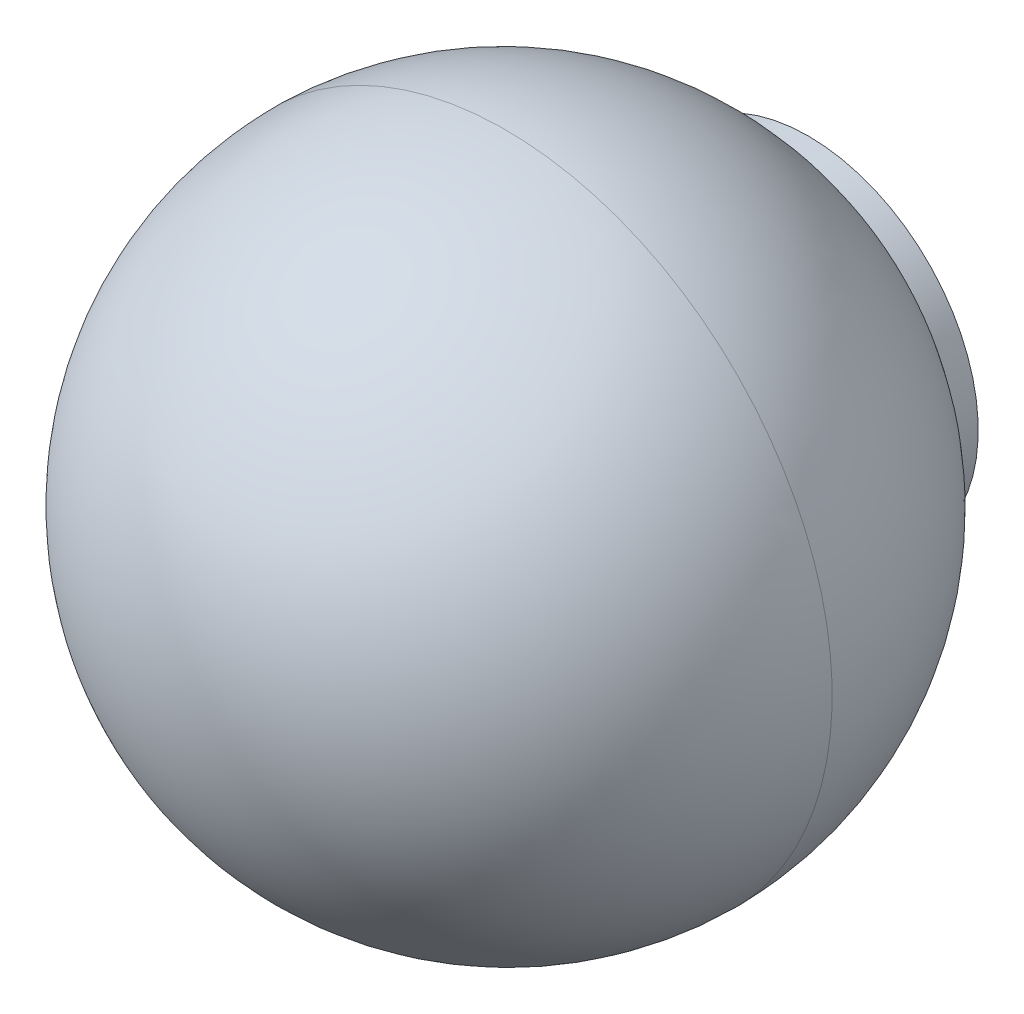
ISO-10303-21;
HEADER;
FILE_DESCRIPTION(('STEP AP214'),'2;1');
FILE_NAME('part.step','',(''),(''),'','','');
FILE_SCHEMA(('AUTOMOTIVE_DESIGN { 1 0 10303 214 1 1 1 1 }'));
ENDSEC;
DATA;
#1=APPLICATION_CONTEXT('core data for automotive mechanical design processes');
#2=APPLICATION_PROTOCOL_DEFINITION('international standard','automotive_design',2000,#1);
#3=PRODUCT_CONTEXT('',#1,'mechanical');
#4=PRODUCT('Part','Part','',(#3));
#5=PRODUCT_RELATED_PRODUCT_CATEGORY('part','',(#4));
#6=PRODUCT_DEFINITION_FORMATION('','',#4);
#7=PRODUCT_DEFINITION_CONTEXT('part definition',#1,'design');
#8=PRODUCT_DEFINITION('design','',#6,#7);
#9=PRODUCT_DEFINITION_SHAPE('','',#8);
#10=(LENGTH_UNIT() NAMED_UNIT(*) SI_UNIT(.MILLI.,.METRE.));
#11=(NAMED_UNIT(*) PLANE_ANGLE_UNIT() SI_UNIT($,.RADIAN.));
#12=(NAMED_UNIT(*) SI_UNIT($,.STERADIAN.) SOLID_ANGLE_UNIT());
#13=UNCERTAINTY_MEASURE_WITH_UNIT(LENGTH_MEASURE(1.E-05),#10,'distance_accuracy_value','');
#14=(GEOMETRIC_REPRESENTATION_CONTEXT(3) GLOBAL_UNCERTAINTY_ASSIGNED_CONTEXT((#13)) GLOBAL_UNIT_ASSIGNED_CONTEXT((#10,
#11,#12)) REPRESENTATION_CONTEXT('',''));
#15=CARTESIAN_POINT('',(0.,0.,0.));
#16=DIRECTION('',(0.,0.,1.));
#17=DIRECTION('',(1.,0.,0.));
#18=AXIS2_PLACEMENT_3D('',#15,#16,#17);
#19=CARTESIAN_POINT('',(0.,0.,23.0000000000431));
#20=DIRECTION('',(0.,0.,1.));
#21=DIRECTION('',(-1.,0.,0.));
#22=AXIS2_PLACEMENT_3D('',#19,#20,#21);
#23=SPHERICAL_SURFACE('',#22,24.9999999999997);
#24=CARTESIAN_POINT('',(0.,0.,23.1770782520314));
#25=DIRECTION('',(0.,0.,1.));
#26=DIRECTION('',(0.,-1.,0.));
#27=AXIS2_PLACEMENT_3D('',#24,#25,#26);
#28=CIRCLE('',#27,24.999372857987);
#29=CARTESIAN_POINT('',(-24.999372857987,0.,23.1770782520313));
#30=VERTEX_POINT('',#29);
#31=EDGE_CURVE('E8',#30,#30,#28,.T.);
#32=ORIENTED_EDGE('',*,*,#31,.T.);
#33=EDGE_LOOP('',(#32));
#34=FACE_BOUND('',#33,.T.);
#35=ADVANCED_FACE('F12',(#34),#23,.T.);
#36=CARTESIAN_POINT('',(0.,0.,23.3541565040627));
#37=DIRECTION('',(0.,0.,1.));
#38=DIRECTION('',(-1.,0.,0.));
#39=AXIS2_PLACEMENT_3D('',#36,#37,#38);
#40=SPHERICAL_SURFACE('',#39,25.);
#41=CARTESIAN_POINT('',(0.,0.,2.));
#42=DIRECTION('',(0.,0.,1.));
#43=DIRECTION('',(0.,-1.,0.));
#44=AXIS2_PLACEMENT_3D('',#41,#42,#43);
#45=CIRCLE('',#44,13.);
#46=CARTESIAN_POINT('',(-13.,0.,2.));
#47=VERTEX_POINT('',#46);
#48=EDGE_CURVE('E18',#47,#47,#45,.T.);
#49=CARTESIAN_POINT('',(-13.,0.,2.));
#50=CARTESIAN_POINT('',(-13.2261907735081,0.,2.13769880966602));
#51=CARTESIAN_POINT('',(-13.4501920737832,0.,2.27899394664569));
#52=CARTESIAN_POINT('',(-13.8935932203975,0.,2.56862860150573));
#53=CARTESIAN_POINT('',(-14.1129930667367,0.,2.7169681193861));
#54=CARTESIAN_POINT('',(-14.5469687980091,0.,3.0205432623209));
#55=CARTESIAN_POINT('',(-14.7615446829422,0.,3.17577888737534));
#56=CARTESIAN_POINT('',(-15.1856560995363,0.,3.49298910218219));
#57=CARTESIAN_POINT('',(-15.3951916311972,0.,3.6549636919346));
#58=CARTESIAN_POINT('',(-15.8090107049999,0.,3.98548840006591));
#59=CARTESIAN_POINT('',(-16.0132942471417,0.,4.15403851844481));
#60=CARTESIAN_POINT('',(-16.4164030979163,0.,4.49754407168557));
#61=CARTESIAN_POINT('',(-16.6152284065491,0.,4.67249950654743));
#62=CARTESIAN_POINT('',(-17.0072200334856,0.,5.02863904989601));
#63=CARTESIAN_POINT('',(-17.2003863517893,0.,5.20982315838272));
#64=CARTESIAN_POINT('',(-17.5808649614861,0.,5.57823710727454));
#65=CARTESIAN_POINT('',(-17.7681772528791,0.,5.76546694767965));
#66=CARTESIAN_POINT('',(-18.1367586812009,0.,6.1457833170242));
#67=CARTESIAN_POINT('',(-18.3180278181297,0.,6.33886984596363));
#68=CARTESIAN_POINT('',(-18.6743399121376,0.,6.73070463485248));
#69=CARTESIAN_POINT('',(-18.8493828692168,0.,6.92945289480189));
#70=CARTESIAN_POINT('',(-19.1930658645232,0.,7.33241047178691));
#71=CARTESIAN_POINT('',(-19.3617059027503,0.,7.53661978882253));
#72=CARTESIAN_POINT('',(-19.692412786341,0.,7.95029329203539));
#73=CARTESIAN_POINT('',(-19.8544796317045,0.,8.15975747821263));
#74=CARTESIAN_POINT('',(-20.1718764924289,0.,8.58372922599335));
#75=CARTESIAN_POINT('',(-20.3272065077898,0.,8.79823678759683));
#76=CARTESIAN_POINT('',(-20.6309728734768,0.,9.23207870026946));
#77=CARTESIAN_POINT('',(-20.7794092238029,0.,9.45141305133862));
#78=CARTESIAN_POINT('',(-21.0692383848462,0.,9.89468708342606));
#79=CARTESIAN_POINT('',(-21.2106311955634,0.,10.1186267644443));
#80=CARTESIAN_POINT('',(-21.4862305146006,0.,10.5708853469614));
#81=CARTESIAN_POINT('',(-21.6204370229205,0.,10.7992042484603));
#82=CARTESIAN_POINT('',(-21.8815282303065,0.,11.2599907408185));
#83=CARTESIAN_POINT('',(-22.0084129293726,0.,11.492458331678));
#84=CARTESIAN_POINT('',(-22.2547324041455,0.,11.9613074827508));
#85=CARTESIAN_POINT('',(-22.3741671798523,0.,12.1976890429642));
#86=CARTESIAN_POINT('',(-22.6054662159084,0.,12.6741274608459));
#87=CARTESIAN_POINT('',(-22.7173304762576,0.,12.9141843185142));
#88=CARTESIAN_POINT('',(-22.9333755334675,0.,13.3977309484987));
#89=CARTESIAN_POINT('',(-23.0375563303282,0.,13.6412207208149));
#90=CARTESIAN_POINT('',(-23.2381292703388,0.,14.1313873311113));
#91=CARTESIAN_POINT('',(-23.3345214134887,0.,14.3780641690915));
#92=CARTESIAN_POINT('',(-23.5194197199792,0.,14.8743558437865));
#93=CARTESIAN_POINT('',(-23.6079258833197,0.,15.1239706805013));
#94=CARTESIAN_POINT('',(-23.7769628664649,0.,15.625886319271));
#95=CARTESIAN_POINT('',(-23.8574936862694,0.,15.8781871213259));
#96=CARTESIAN_POINT('',(-24.0104986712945,0.,16.3852199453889));
#97=CARTESIAN_POINT('',(-24.082972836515,0.,16.6399519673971));
#98=CARTESIAN_POINT('',(-24.219791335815,0.,17.1515900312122));
#99=CARTESIAN_POINT('',(-24.2841356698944,0.,17.4084960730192));
#100=CARTESIAN_POINT('',(-24.4046295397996,0.,17.9242227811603));
#101=CARTESIAN_POINT('',(-24.4607790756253,0.,18.1830434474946));
#102=CARTESIAN_POINT('',(-24.5648266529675,0.,18.7023380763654));
#103=CARTESIAN_POINT('',(-24.6127246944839,0.,18.962812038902));
#104=CARTESIAN_POINT('',(-24.7002209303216,0.,19.4851502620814));
#105=CARTESIAN_POINT('',(-24.7398191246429,0.,19.7470145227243));
#106=CARTESIAN_POINT('',(-24.8106756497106,0.,20.2718689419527));
#107=CARTESIAN_POINT('',(-24.841933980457,0.,20.5348591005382));
#108=CARTESIAN_POINT('',(-24.8960793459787,0.,21.0616997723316));
#109=CARTESIAN_POINT('',(-24.9189663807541,0.,21.3255502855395));
#110=CARTESIAN_POINT('',(-24.9563455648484,0.,21.853845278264));
#111=CARTESIAN_POINT('',(-24.9708377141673,0.,22.1182897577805));
#112=CARTESIAN_POINT('',(-24.9914142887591,0.,22.6475056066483));
#113=CARTESIAN_POINT('',(-24.997498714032,0.,22.9122769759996));
#114=CARTESIAN_POINT('',(-24.999372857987,0.,23.1770782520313));
#115=B_SPLINE_CURVE_WITH_KNOTS('',3,(#49,#50,#51,#52,#53,#54,#55,#56,#57,#58,#59,#60,#61,#62,
#63,#64,#65,#66,#67,#68,#69,#70,#71,#72,#73,#74,#75,#76,#77,#78,#79,#80,#81,#82,#83,#84,#85,#86,
#87,#88,#89,#90,#91,#92,#93,#94,#95,#96,#97,#98,#99,#100,#101,#102,#103,#104,#105,#106,#107,
#108,#109,#110,#111,#112,#113,#114),.UNSPECIFIED.,.F.,.F.,(4,2,2,2,2,2,2,2,2,2,2,2,2,2,2,2,2,2,
2,2,2,2,2,2,2,2,2,2,2,2,2,2,4),(0.,0.794390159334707,1.58878031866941,2.38317047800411,
3.17756063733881,3.97195079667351,4.76634095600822,5.56073111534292,6.35512127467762,
7.14951143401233,7.94390159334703,8.73829175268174,9.53268191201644,10.3270720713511,
11.1214622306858,11.9158523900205,12.7102425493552,13.5046327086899,14.2990228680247,
15.0934130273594,15.8878031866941,16.6821933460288,17.4765835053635,18.2709736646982,
19.0653638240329,19.8597539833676,20.6541441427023,21.448534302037,22.2429244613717,
23.0373146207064,23.8317047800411,24.6260949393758,25.4204850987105),.UNSPECIFIED.);
#116=EDGE_CURVE('BSEAM49',#47,#30,#115,.T.);
#117=ORIENTED_EDGE('',*,*,#48,.T.);
#118=ORIENTED_EDGE('',*,*,#31,.F.);
#119=ORIENTED_EDGE('',*,*,#116,.T.);
#120=ORIENTED_EDGE('',*,*,#116,.F.);
#121=EDGE_LOOP('',(#117,#119,#118,#120));
#122=FACE_BOUND('',#121,.T.);
#123=ADVANCED_FACE('F49',(#122),#40,.T.);
#124=CARTESIAN_POINT('',(0.,0.,53.));
#125=DIRECTION('',(0.,0.,1.));
#126=DIRECTION('',(0.,-1.,0.));
#127=AXIS2_PLACEMENT_3D('',#124,#125,#126);
#128=CYLINDRICAL_SURFACE('',#127,13.);
#129=CARTESIAN_POINT('',(0.,0.,0.));
#130=DIRECTION('',(0.,0.,1.));
#131=DIRECTION('',(0.,-1.,0.));
#132=AXIS2_PLACEMENT_3D('',#129,#130,#131);
#133=CIRCLE('',#132,13.);
#134=CARTESIAN_POINT('',(0.,-13.,0.));
#135=VERTEX_POINT('',#134);
#136=EDGE_CURVE('E22',#135,#135,#133,.T.);
#137=ORIENTED_EDGE('',*,*,#136,.T.);
#138=EDGE_LOOP('',(#137));
#139=FACE_BOUND('',#138,.T.);
#140=ORIENTED_EDGE('',*,*,#48,.F.);
#141=EDGE_LOOP('',(#140));
#142=FACE_BOUND('',#141,.T.);
#143=ADVANCED_FACE('F54',(#139,#142),#128,.T.);
#144=CARTESIAN_POINT('',(-13.,0.,0.));
#145=DIRECTION('',(0.,0.,-1.));
#146=DIRECTION('',(0.,1.,0.));
#147=AXIS2_PLACEMENT_3D('',#144,#145,#146);
#148=PLANE('',#147);
#149=CARTESIAN_POINT('',(0.,0.,0.));
#150=DIRECTION('',(0.,0.,1.));
#151=DIRECTION('',(0.,-1.,0.));
#152=AXIS2_PLACEMENT_3D('',#149,#150,#151);
#153=CIRCLE('',#152,6.);
#154=CARTESIAN_POINT('',(0.,-6.,0.));
#155=VERTEX_POINT('',#154);
#156=EDGE_CURVE('E26',#155,#155,#153,.T.);
#157=ORIENTED_EDGE('',*,*,#156,.T.);
#158=EDGE_LOOP('',(#157));
#159=FACE_BOUND('',#158,.T.);
#160=ORIENTED_EDGE('',*,*,#136,.F.);
#161=EDGE_LOOP('',(#160));
#162=FACE_BOUND('',#161,.T.);
#163=ADVANCED_FACE('F46',(#159,#162),#148,.T.);
#164=CARTESIAN_POINT('',(0.,0.,53.));
#165=DIRECTION('',(0.,0.,1.));
#166=DIRECTION('',(0.,-1.,0.));
#167=AXIS2_PLACEMENT_3D('',#164,#165,#166);
#168=CYLINDRICAL_SURFACE('',#167,6.);
#169=CARTESIAN_POINT('',(0.,0.,22.));
#170=DIRECTION('',(0.,0.,1.));
#171=DIRECTION('',(0.,-1.,0.));
#172=AXIS2_PLACEMENT_3D('',#169,#170,#171);
#173=CIRCLE('',#172,6.);
#174=CARTESIAN_POINT('',(0.,-6.,22.));
#175=VERTEX_POINT('',#174);
#176=EDGE_CURVE('E31',#175,#175,#173,.T.);
#177=ORIENTED_EDGE('',*,*,#176,.T.);
#178=EDGE_LOOP('',(#177));
#179=FACE_BOUND('',#178,.T.);
#180=ORIENTED_EDGE('',*,*,#156,.F.);
#181=EDGE_LOOP('',(#180));
#182=FACE_BOUND('',#181,.T.);
#183=ADVANCED_FACE('F35',(#179,#182),#168,.F.);
#184=CARTESIAN_POINT('',(-6.,0.,22.));
#185=DIRECTION('',(0.,0.,-1.));
#186=DIRECTION('',(0.,1.,0.));
#187=AXIS2_PLACEMENT_3D('',#184,#185,#186);
#188=PLANE('',#187);
#189=ORIENTED_EDGE('',*,*,#176,.F.);
#190=EDGE_LOOP('',(#189));
#191=FACE_BOUND('',#190,.T.);
#192=ADVANCED_FACE('F38',(#191),#188,.T.);
#193=CLOSED_SHELL('',(#35,#123,#143,#163,#183,#192));
#194=MANIFOLD_SOLID_BREP('B1',#193);
#195=ADVANCED_BREP_SHAPE_REPRESENTATION('',(#18,#194),#14);
#196=SHAPE_DEFINITION_REPRESENTATION(#9,#195);
ENDSEC;
END-ISO-10303-21;
